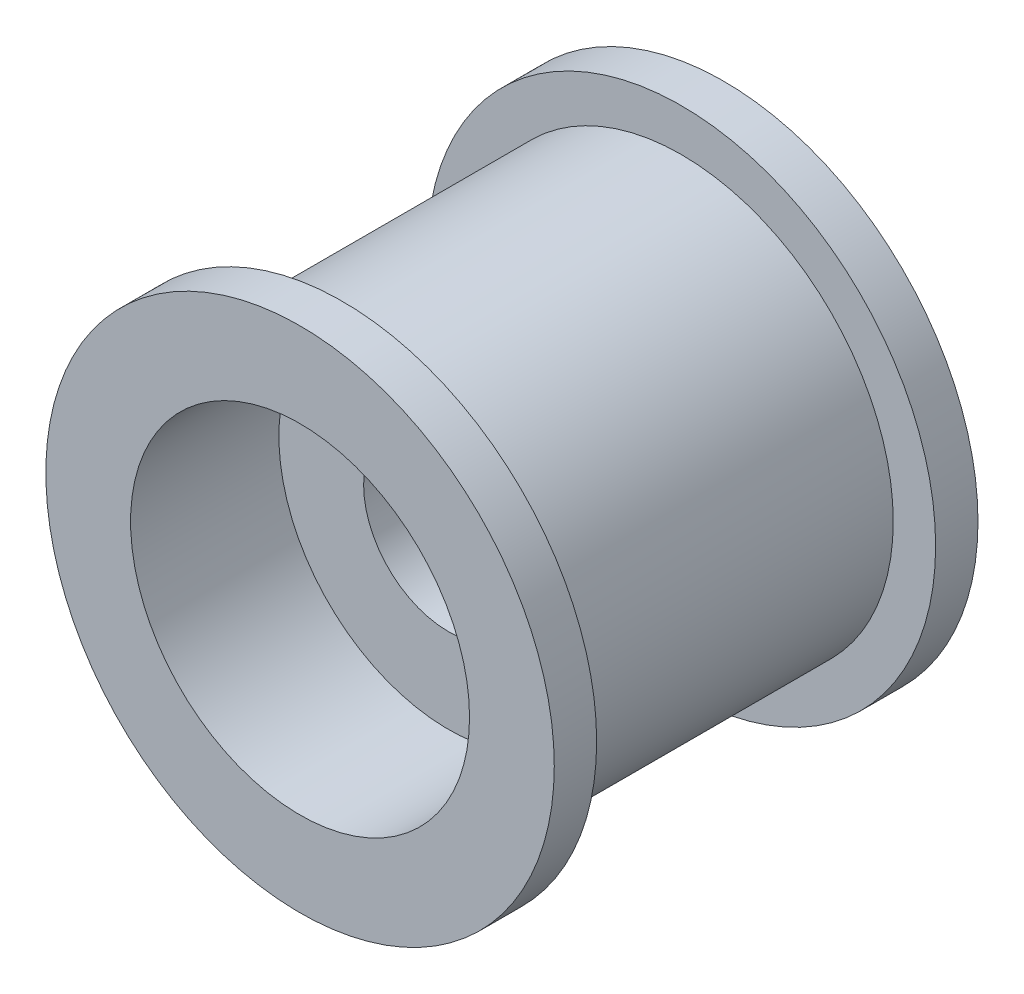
ISO-10303-21;
HEADER;
FILE_DESCRIPTION(('STEP AP214'),'2;1');
FILE_NAME('part.step','',(''),(''),'','','');
FILE_SCHEMA(('AUTOMOTIVE_DESIGN { 1 0 10303 214 1 1 1 1 }'));
ENDSEC;
DATA;
#1=APPLICATION_CONTEXT('core data for automotive mechanical design processes');
#2=APPLICATION_PROTOCOL_DEFINITION('international standard','automotive_design',2000,#1);
#3=PRODUCT_CONTEXT('',#1,'mechanical');
#4=PRODUCT('Part','Part','',(#3));
#5=PRODUCT_RELATED_PRODUCT_CATEGORY('part','',(#4));
#6=PRODUCT_DEFINITION_FORMATION('','',#4);
#7=PRODUCT_DEFINITION_CONTEXT('part definition',#1,'design');
#8=PRODUCT_DEFINITION('design','',#6,#7);
#9=PRODUCT_DEFINITION_SHAPE('','',#8);
#10=(LENGTH_UNIT() NAMED_UNIT(*) SI_UNIT(.MILLI.,.METRE.));
#11=(NAMED_UNIT(*) PLANE_ANGLE_UNIT() SI_UNIT($,.RADIAN.));
#12=(NAMED_UNIT(*) SI_UNIT($,.STERADIAN.) SOLID_ANGLE_UNIT());
#13=UNCERTAINTY_MEASURE_WITH_UNIT(LENGTH_MEASURE(1.E-05),#10,'distance_accuracy_value','');
#14=(GEOMETRIC_REPRESENTATION_CONTEXT(3) GLOBAL_UNCERTAINTY_ASSIGNED_CONTEXT((#13)) GLOBAL_UNIT_ASSIGNED_CONTEXT((#10,
#11,#12)) REPRESENTATION_CONTEXT('',''));
#15=CARTESIAN_POINT('',(0.,0.,0.));
#16=DIRECTION('',(0.,0.,1.));
#17=DIRECTION('',(1.,0.,0.));
#18=AXIS2_PLACEMENT_3D('',#15,#16,#17);
#19=CARTESIAN_POINT('',(0.,0.,10.));
#20=DIRECTION('',(0.,0.,-1.));
#21=DIRECTION('',(-1.,0.,0.));
#22=AXIS2_PLACEMENT_3D('',#19,#20,#21);
#23=CYLINDRICAL_SURFACE('',#22,6.);
#24=CARTESIAN_POINT('',(0.,0.,0.));
#25=DIRECTION('',(0.,0.,1.));
#26=DIRECTION('',(1.,0.,0.));
#27=AXIS2_PLACEMENT_3D('',#24,#25,#26);
#28=CIRCLE('',#27,6.);
#29=CARTESIAN_POINT('',(6.,0.,0.));
#30=VERTEX_POINT('',#29);
#31=EDGE_CURVE('E36',#30,#30,#28,.T.);
#32=ORIENTED_EDGE('',*,*,#31,.T.);
#33=EDGE_LOOP('',(#32));
#34=FACE_BOUND('',#33,.T.);
#35=CARTESIAN_POINT('',(0.,0.,1.));
#36=DIRECTION('',(0.,0.,1.));
#37=DIRECTION('',(1.,0.,0.));
#38=AXIS2_PLACEMENT_3D('',#35,#36,#37);
#39=CIRCLE('',#38,6.);
#40=CARTESIAN_POINT('',(6.,0.,1.));
#41=VERTEX_POINT('',#40);
#42=EDGE_CURVE('E43',#41,#41,#39,.T.);
#43=ORIENTED_EDGE('',*,*,#42,.F.);
#44=EDGE_LOOP('',(#43));
#45=FACE_BOUND('',#44,.T.);
#46=ADVANCED_FACE('F32',(#34,#45),#23,.T.);
#47=CARTESIAN_POINT('',(0.,0.,0.));
#48=DIRECTION('',(0.,0.,1.));
#49=DIRECTION('',(1.,0.,0.));
#50=AXIS2_PLACEMENT_3D('',#47,#48,#49);
#51=PLANE('',#50);
#52=CARTESIAN_POINT('',(0.,0.,0.));
#53=DIRECTION('',(0.,0.,1.));
#54=DIRECTION('',(1.,0.,0.));
#55=AXIS2_PLACEMENT_3D('',#52,#53,#54);
#56=CIRCLE('',#55,4.);
#57=CARTESIAN_POINT('',(4.,0.,0.));
#58=VERTEX_POINT('',#57);
#59=EDGE_CURVE('E63',#58,#58,#56,.T.);
#60=ORIENTED_EDGE('',*,*,#59,.T.);
#61=EDGE_LOOP('',(#60));
#62=FACE_BOUND('',#61,.T.);
#63=ORIENTED_EDGE('',*,*,#31,.F.);
#64=EDGE_LOOP('',(#63));
#65=FACE_BOUND('',#64,.T.);
#66=ADVANCED_FACE('F90',(#62,#65),#51,.F.);
#67=CARTESIAN_POINT('',(0.,0.,1.));
#68=DIRECTION('',(0.,0.,1.));
#69=DIRECTION('',(1.,0.,0.));
#70=AXIS2_PLACEMENT_3D('',#67,#68,#69);
#71=PLANE('',#70);
#72=CARTESIAN_POINT('',(0.,0.,1.));
#73=DIRECTION('',(0.,0.,1.));
#74=DIRECTION('',(1.,0.,0.));
#75=AXIS2_PLACEMENT_3D('',#72,#73,#74);
#76=CIRCLE('',#75,5.);
#77=CARTESIAN_POINT('',(5.,0.,1.));
#78=VERTEX_POINT('',#77);
#79=EDGE_CURVE('E48',#78,#78,#76,.T.);
#80=ORIENTED_EDGE('',*,*,#79,.F.);
#81=EDGE_LOOP('',(#80));
#82=FACE_BOUND('',#81,.T.);
#83=ORIENTED_EDGE('',*,*,#42,.T.);
#84=EDGE_LOOP('',(#83));
#85=FACE_BOUND('',#84,.T.);
#86=ADVANCED_FACE('F93',(#82,#85),#71,.T.);
#87=CARTESIAN_POINT('',(0.,0.,9.));
#88=DIRECTION('',(0.,0.,1.));
#89=DIRECTION('',(1.,0.,0.));
#90=AXIS2_PLACEMENT_3D('',#87,#88,#89);
#91=PLANE('',#90);
#92=CARTESIAN_POINT('',(0.,0.,9.));
#93=DIRECTION('',(0.,0.,1.));
#94=DIRECTION('',(1.,0.,0.));
#95=AXIS2_PLACEMENT_3D('',#92,#93,#94);
#96=CIRCLE('',#95,5.);
#97=CARTESIAN_POINT('',(5.,0.,9.));
#98=VERTEX_POINT('',#97);
#99=EDGE_CURVE('E51',#98,#98,#96,.T.);
#100=ORIENTED_EDGE('',*,*,#99,.T.);
#101=EDGE_LOOP('',(#100));
#102=FACE_BOUND('',#101,.T.);
#103=CARTESIAN_POINT('',(0.,0.,9.));
#104=DIRECTION('',(0.,0.,1.));
#105=DIRECTION('',(1.,0.,0.));
#106=AXIS2_PLACEMENT_3D('',#103,#104,#105);
#107=CIRCLE('',#106,6.);
#108=CARTESIAN_POINT('',(6.,0.,9.));
#109=VERTEX_POINT('',#108);
#110=EDGE_CURVE('E45',#109,#109,#107,.T.);
#111=ORIENTED_EDGE('',*,*,#110,.F.);
#112=EDGE_LOOP('',(#111));
#113=FACE_BOUND('',#112,.T.);
#114=ADVANCED_FACE('F101',(#102,#113),#91,.F.);
#115=CARTESIAN_POINT('',(0.,0.,1.));
#116=DIRECTION('',(0.,0.,1.));
#117=DIRECTION('',(1.,0.,0.));
#118=AXIS2_PLACEMENT_3D('',#115,#116,#117);
#119=CYLINDRICAL_SURFACE('',#118,5.);
#120=ORIENTED_EDGE('',*,*,#79,.T.);
#121=EDGE_LOOP('',(#120));
#122=FACE_BOUND('',#121,.T.);
#123=ORIENTED_EDGE('',*,*,#99,.F.);
#124=EDGE_LOOP('',(#123));
#125=FACE_BOUND('',#124,.T.);
#126=ADVANCED_FACE('F107',(#122,#125),#119,.T.);
#127=CARTESIAN_POINT('',(0.,0.,10.));
#128=DIRECTION('',(0.,0.,1.));
#129=DIRECTION('',(1.,0.,0.));
#130=AXIS2_PLACEMENT_3D('',#127,#128,#129);
#131=PLANE('',#130);
#132=CARTESIAN_POINT('',(0.,0.,10.));
#133=DIRECTION('',(0.,0.,1.));
#134=DIRECTION('',(1.,0.,0.));
#135=AXIS2_PLACEMENT_3D('',#132,#133,#134);
#136=CIRCLE('',#135,4.);
#137=CARTESIAN_POINT('',(4.,0.,10.));
#138=VERTEX_POINT('',#137);
#139=EDGE_CURVE('E57',#138,#138,#136,.T.);
#140=ORIENTED_EDGE('',*,*,#139,.F.);
#141=EDGE_LOOP('',(#140));
#142=FACE_BOUND('',#141,.T.);
#143=CARTESIAN_POINT('',(0.,0.,10.));
#144=DIRECTION('',(0.,0.,1.));
#145=DIRECTION('',(1.,0.,0.));
#146=AXIS2_PLACEMENT_3D('',#143,#144,#145);
#147=CIRCLE('',#146,6.);
#148=CARTESIAN_POINT('',(6.,0.,10.));
#149=VERTEX_POINT('',#148);
#150=EDGE_CURVE('E10',#149,#149,#147,.T.);
#151=ORIENTED_EDGE('',*,*,#150,.T.);
#152=EDGE_LOOP('',(#151));
#153=FACE_BOUND('',#152,.T.);
#154=ADVANCED_FACE('F114',(#142,#153),#131,.T.);
#155=ORIENTED_EDGE('',*,*,#110,.T.);
#156=EDGE_LOOP('',(#155));
#157=FACE_BOUND('',#156,.T.);
#158=ORIENTED_EDGE('',*,*,#150,.F.);
#159=EDGE_LOOP('',(#158));
#160=FACE_BOUND('',#159,.T.);
#161=ADVANCED_FACE('F34',(#157,#160),#23,.T.);
#162=CARTESIAN_POINT('',(0.,0.,6.5));
#163=DIRECTION('',(0.,0.,1.));
#164=DIRECTION('',(1.,0.,0.));
#165=AXIS2_PLACEMENT_3D('',#162,#163,#164);
#166=CYLINDRICAL_SURFACE('',#165,4.);
#167=CARTESIAN_POINT('',(0.,0.,6.5));
#168=DIRECTION('',(0.,0.,1.));
#169=DIRECTION('',(1.,0.,0.));
#170=AXIS2_PLACEMENT_3D('',#167,#168,#169);
#171=CIRCLE('',#170,4.);
#172=CARTESIAN_POINT('',(4.,0.,6.5));
#173=VERTEX_POINT('',#172);
#174=EDGE_CURVE('E54',#173,#173,#171,.T.);
#175=ORIENTED_EDGE('',*,*,#174,.F.);
#176=EDGE_LOOP('',(#175));
#177=FACE_BOUND('',#176,.T.);
#178=ORIENTED_EDGE('',*,*,#139,.T.);
#179=EDGE_LOOP('',(#178));
#180=FACE_BOUND('',#179,.T.);
#181=ADVANCED_FACE('F121',(#177,#180),#166,.F.);
#182=CARTESIAN_POINT('',(0.,0.,6.5));
#183=DIRECTION('',(0.,0.,1.));
#184=DIRECTION('',(1.,0.,0.));
#185=AXIS2_PLACEMENT_3D('',#182,#183,#184);
#186=PLANE('',#185);
#187=CARTESIAN_POINT('',(0.,0.,6.5));
#188=DIRECTION('',(0.,0.,1.));
#189=DIRECTION('',(1.,0.,0.));
#190=AXIS2_PLACEMENT_3D('',#187,#188,#189);
#191=CIRCLE('',#190,2.);
#192=CARTESIAN_POINT('',(2.,0.,6.5));
#193=VERTEX_POINT('',#192);
#194=EDGE_CURVE('E66',#193,#193,#191,.T.);
#195=ORIENTED_EDGE('',*,*,#194,.F.);
#196=EDGE_LOOP('',(#195));
#197=FACE_BOUND('',#196,.T.);
#198=ORIENTED_EDGE('',*,*,#174,.T.);
#199=EDGE_LOOP('',(#198));
#200=FACE_BOUND('',#199,.T.);
#201=ADVANCED_FACE('F86',(#197,#200),#186,.T.);
#202=CARTESIAN_POINT('',(0.,0.,3.5));
#203=DIRECTION('',(0.,0.,-1.));
#204=DIRECTION('',(-1.,0.,0.));
#205=AXIS2_PLACEMENT_3D('',#202,#203,#204);
#206=CYLINDRICAL_SURFACE('',#205,4.);
#207=CARTESIAN_POINT('',(0.,0.,3.5));
#208=DIRECTION('',(0.,0.,1.));
#209=DIRECTION('',(1.,0.,0.));
#210=AXIS2_PLACEMENT_3D('',#207,#208,#209);
#211=CIRCLE('',#210,4.);
#212=CARTESIAN_POINT('',(4.,0.,3.5));
#213=VERTEX_POINT('',#212);
#214=EDGE_CURVE('E60',#213,#213,#211,.T.);
#215=ORIENTED_EDGE('',*,*,#214,.T.);
#216=EDGE_LOOP('',(#215));
#217=FACE_BOUND('',#216,.T.);
#218=ORIENTED_EDGE('',*,*,#59,.F.);
#219=EDGE_LOOP('',(#218));
#220=FACE_BOUND('',#219,.T.);
#221=ADVANCED_FACE('F80',(#217,#220),#206,.F.);
#222=CARTESIAN_POINT('',(0.,0.,3.5));
#223=DIRECTION('',(0.,0.,-1.));
#224=DIRECTION('',(1.,0.,0.));
#225=AXIS2_PLACEMENT_3D('',#222,#223,#224);
#226=PLANE('',#225);
#227=CARTESIAN_POINT('',(0.,0.,3.5));
#228=DIRECTION('',(0.,0.,-1.));
#229=DIRECTION('',(-1.,0.,0.));
#230=AXIS2_PLACEMENT_3D('',#227,#228,#229);
#231=CIRCLE('',#230,2.);
#232=CARTESIAN_POINT('',(-2.,0.,3.5));
#233=VERTEX_POINT('',#232);
#234=EDGE_CURVE('E71',#233,#233,#231,.T.);
#235=ORIENTED_EDGE('',*,*,#234,.F.);
#236=EDGE_LOOP('',(#235));
#237=FACE_BOUND('',#236,.T.);
#238=ORIENTED_EDGE('',*,*,#214,.F.);
#239=EDGE_LOOP('',(#238));
#240=FACE_BOUND('',#239,.T.);
#241=ADVANCED_FACE('F77',(#237,#240),#226,.T.);
#242=CARTESIAN_POINT('',(0.,0.,10.));
#243=DIRECTION('',(0.,0.,-1.));
#244=DIRECTION('',(-1.,0.,0.));
#245=AXIS2_PLACEMENT_3D('',#242,#243,#244);
#246=CYLINDRICAL_SURFACE('',#245,2.);
#247=ORIENTED_EDGE('',*,*,#194,.T.);
#248=EDGE_LOOP('',(#247));
#249=FACE_BOUND('',#248,.T.);
#250=ORIENTED_EDGE('',*,*,#234,.T.);
#251=EDGE_LOOP('',(#250));
#252=FACE_BOUND('',#251,.T.);
#253=ADVANCED_FACE('F75',(#249,#252),#246,.F.);
#254=CLOSED_SHELL('',(#46,#66,#86,#114,#126,#154,#161,#181,#201,#221,#241,#253));
#255=MANIFOLD_SOLID_BREP('B2',#254);
#256=ADVANCED_BREP_SHAPE_REPRESENTATION('',(#18,#255),#14);
#257=SHAPE_DEFINITION_REPRESENTATION(#9,#256);
ENDSEC;
END-ISO-10303-21;
